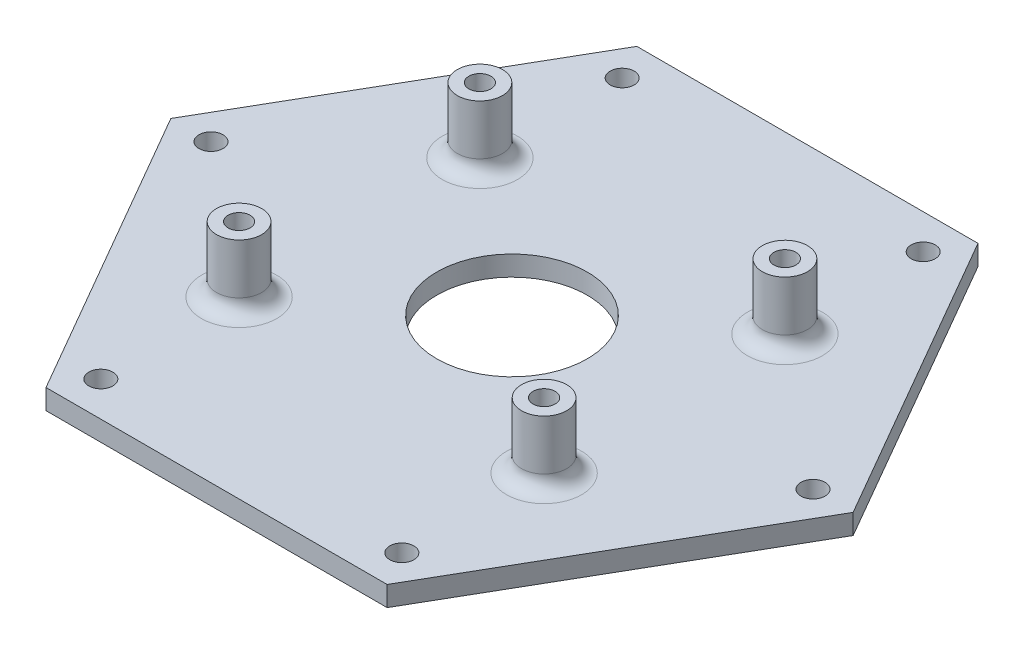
ISO-10303-21;
HEADER;
FILE_DESCRIPTION(('STEP AP214'),'2;1');
FILE_NAME('part.step','',(''),(''),'','','');
FILE_SCHEMA(('AUTOMOTIVE_DESIGN { 1 0 10303 214 1 1 1 1 }'));
ENDSEC;
DATA;
#1=APPLICATION_CONTEXT('core data for automotive mechanical design processes');
#2=APPLICATION_PROTOCOL_DEFINITION('international standard','automotive_design',2000,#1);
#3=PRODUCT_CONTEXT('',#1,'mechanical');
#4=PRODUCT('Part','Part','',(#3));
#5=PRODUCT_RELATED_PRODUCT_CATEGORY('part','',(#4));
#6=PRODUCT_DEFINITION_FORMATION('','',#4);
#7=PRODUCT_DEFINITION_CONTEXT('part definition',#1,'design');
#8=PRODUCT_DEFINITION('design','',#6,#7);
#9=PRODUCT_DEFINITION_SHAPE('','',#8);
#10=(LENGTH_UNIT() NAMED_UNIT(*) SI_UNIT(.MILLI.,.METRE.));
#11=(NAMED_UNIT(*) PLANE_ANGLE_UNIT() SI_UNIT($,.RADIAN.));
#12=(NAMED_UNIT(*) SI_UNIT($,.STERADIAN.) SOLID_ANGLE_UNIT());
#13=UNCERTAINTY_MEASURE_WITH_UNIT(LENGTH_MEASURE(1.E-05),#10,'distance_accuracy_value','');
#14=(GEOMETRIC_REPRESENTATION_CONTEXT(3) GLOBAL_UNCERTAINTY_ASSIGNED_CONTEXT((#13)) GLOBAL_UNIT_ASSIGNED_CONTEXT((#10,
#11,#12)) REPRESENTATION_CONTEXT('',''));
#15=CARTESIAN_POINT('',(0.,0.,0.));
#16=DIRECTION('',(0.,0.,1.));
#17=DIRECTION('',(1.,0.,0.));
#18=AXIS2_PLACEMENT_3D('',#15,#16,#17);
#19=CARTESIAN_POINT('',(17.,2.,29.4448637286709));
#20=DIRECTION('',(-0.866025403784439,0.,-0.5));
#21=DIRECTION('',(-0.5,0.,0.866025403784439));
#22=AXIS2_PLACEMENT_3D('',#19,#20,#21);
#23=PLANE('',#22);
#24=DIRECTION('',(0.5,0.,-0.866025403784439));
#25=VECTOR('',#24,1.);
#26=CARTESIAN_POINT('',(17.,0.,29.4448637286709));
#27=LINE('',#26,#25);
#28=CARTESIAN_POINT('',(17.,0.,29.4448637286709));
#29=VERTEX_POINT('',#28);
#30=CARTESIAN_POINT('',(34.,0.,0.));
#31=VERTEX_POINT('',#30);
#32=EDGE_CURVE('E119',#29,#31,#27,.T.);
#33=ORIENTED_EDGE('',*,*,#32,.T.);
#34=DIRECTION('',(0.,-1.,0.));
#35=VECTOR('',#34,1.);
#36=CARTESIAN_POINT('',(34.,2.,0.));
#37=LINE('',#36,#35);
#38=CARTESIAN_POINT('',(34.,2.,0.));
#39=VERTEX_POINT('',#38);
#40=EDGE_CURVE('E137',#39,#31,#37,.T.);
#41=ORIENTED_EDGE('',*,*,#40,.F.);
#42=DIRECTION('',(0.5,0.,-0.866025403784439));
#43=VECTOR('',#42,1.);
#44=CARTESIAN_POINT('',(17.,2.,29.4448637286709));
#45=LINE('',#44,#43);
#46=CARTESIAN_POINT('',(17.,2.,29.4448637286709));
#47=VERTEX_POINT('',#46);
#48=EDGE_CURVE('E130',#47,#39,#45,.T.);
#49=ORIENTED_EDGE('',*,*,#48,.F.);
#50=DIRECTION('',(0.,-1.,0.));
#51=VECTOR('',#50,1.);
#52=CARTESIAN_POINT('',(17.,2.,29.4448637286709));
#53=LINE('',#52,#51);
#54=EDGE_CURVE('E115',#47,#29,#53,.T.);
#55=ORIENTED_EDGE('',*,*,#54,.T.);
#56=EDGE_LOOP('',(#33,#41,#49,#55));
#57=FACE_BOUND('',#56,.T.);
#58=ADVANCED_FACE('F33',(#57),#23,.F.);
#59=CARTESIAN_POINT('',(34.,2.,0.));
#60=DIRECTION('',(-0.866025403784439,0.,0.5));
#61=DIRECTION('',(0.5,0.,0.866025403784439));
#62=AXIS2_PLACEMENT_3D('',#59,#60,#61);
#63=PLANE('',#62);
#64=DIRECTION('',(-0.5,0.,-0.866025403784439));
#65=VECTOR('',#64,1.);
#66=CARTESIAN_POINT('',(34.,0.,0.));
#67=LINE('',#66,#65);
#68=CARTESIAN_POINT('',(17.,0.,-29.4448637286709));
#69=VERTEX_POINT('',#68);
#70=EDGE_CURVE('E122',#31,#69,#67,.T.);
#71=ORIENTED_EDGE('',*,*,#70,.T.);
#72=DIRECTION('',(0.,-1.,0.));
#73=VECTOR('',#72,1.);
#74=CARTESIAN_POINT('',(17.,2.,-29.4448637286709));
#75=LINE('',#74,#73);
#76=CARTESIAN_POINT('',(17.,2.,-29.4448637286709));
#77=VERTEX_POINT('',#76);
#78=EDGE_CURVE('E134',#77,#69,#75,.T.);
#79=ORIENTED_EDGE('',*,*,#78,.F.);
#80=DIRECTION('',(-0.5,0.,-0.866025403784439));
#81=VECTOR('',#80,1.);
#82=CARTESIAN_POINT('',(34.,2.,0.));
#83=LINE('',#82,#81);
#84=EDGE_CURVE('E88',#39,#77,#83,.T.);
#85=ORIENTED_EDGE('',*,*,#84,.F.);
#86=ORIENTED_EDGE('',*,*,#40,.T.);
#87=EDGE_LOOP('',(#71,#79,#85,#86));
#88=FACE_BOUND('',#87,.T.);
#89=ADVANCED_FACE('F176',(#88),#63,.F.);
#90=CARTESIAN_POINT('',(17.,2.,-29.4448637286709));
#91=DIRECTION('',(0.,0.,1.));
#92=DIRECTION('',(1.,0.,0.));
#93=AXIS2_PLACEMENT_3D('',#90,#91,#92);
#94=PLANE('',#93);
#95=DIRECTION('',(-1.,0.,0.));
#96=VECTOR('',#95,1.);
#97=CARTESIAN_POINT('',(17.,0.,-29.4448637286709));
#98=LINE('',#97,#96);
#99=CARTESIAN_POINT('',(-17.,0.,-29.4448637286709));
#100=VERTEX_POINT('',#99);
#101=EDGE_CURVE('E125',#69,#100,#98,.T.);
#102=ORIENTED_EDGE('',*,*,#101,.T.);
#103=DIRECTION('',(0.,-1.,0.));
#104=VECTOR('',#103,1.);
#105=CARTESIAN_POINT('',(-17.,2.,-29.4448637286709));
#106=LINE('',#105,#104);
#107=CARTESIAN_POINT('',(-17.,2.,-29.4448637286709));
#108=VERTEX_POINT('',#107);
#109=EDGE_CURVE('E110',#108,#100,#106,.T.);
#110=ORIENTED_EDGE('',*,*,#109,.F.);
#111=DIRECTION('',(-1.,0.,0.));
#112=VECTOR('',#111,1.);
#113=CARTESIAN_POINT('',(17.,2.,-29.4448637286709));
#114=LINE('',#113,#112);
#115=EDGE_CURVE('E101',#77,#108,#114,.T.);
#116=ORIENTED_EDGE('',*,*,#115,.F.);
#117=ORIENTED_EDGE('',*,*,#78,.T.);
#118=EDGE_LOOP('',(#102,#110,#116,#117));
#119=FACE_BOUND('',#118,.T.);
#120=ADVANCED_FACE('F182',(#119),#94,.F.);
#121=CARTESIAN_POINT('',(-17.,2.,-29.4448637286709));
#122=DIRECTION('',(0.866025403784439,0.,0.5));
#123=DIRECTION('',(0.5,0.,-0.866025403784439));
#124=AXIS2_PLACEMENT_3D('',#121,#122,#123);
#125=PLANE('',#124);
#126=DIRECTION('',(-0.5,0.,0.866025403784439));
#127=VECTOR('',#126,1.);
#128=CARTESIAN_POINT('',(-17.,0.,-29.4448637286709));
#129=LINE('',#128,#127);
#130=CARTESIAN_POINT('',(-34.,0.,0.));
#131=VERTEX_POINT('',#130);
#132=EDGE_CURVE('E109',#100,#131,#129,.T.);
#133=ORIENTED_EDGE('',*,*,#132,.T.);
#134=DIRECTION('',(0.,-1.,0.));
#135=VECTOR('',#134,1.);
#136=CARTESIAN_POINT('',(-34.,2.,0.));
#137=LINE('',#136,#135);
#138=CARTESIAN_POINT('',(-34.,2.,0.));
#139=VERTEX_POINT('',#138);
#140=EDGE_CURVE('E106',#139,#131,#137,.T.);
#141=ORIENTED_EDGE('',*,*,#140,.F.);
#142=DIRECTION('',(-0.5,0.,0.866025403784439));
#143=VECTOR('',#142,1.);
#144=CARTESIAN_POINT('',(-17.,2.,-29.4448637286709));
#145=LINE('',#144,#143);
#146=EDGE_CURVE('E95',#108,#139,#145,.T.);
#147=ORIENTED_EDGE('',*,*,#146,.F.);
#148=ORIENTED_EDGE('',*,*,#109,.T.);
#149=EDGE_LOOP('',(#133,#141,#147,#148));
#150=FACE_BOUND('',#149,.T.);
#151=ADVANCED_FACE('F107',(#150),#125,.F.);
#152=CARTESIAN_POINT('',(-34.,2.,0.));
#153=DIRECTION('',(0.866025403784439,0.,-0.5));
#154=DIRECTION('',(-0.5,0.,-0.866025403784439));
#155=AXIS2_PLACEMENT_3D('',#152,#153,#154);
#156=PLANE('',#155);
#157=DIRECTION('',(0.5,0.,0.866025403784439));
#158=VECTOR('',#157,1.);
#159=CARTESIAN_POINT('',(-34.,0.,0.));
#160=LINE('',#159,#158);
#161=CARTESIAN_POINT('',(-17.,0.,29.4448637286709));
#162=VERTEX_POINT('',#161);
#163=EDGE_CURVE('E73',#131,#162,#160,.T.);
#164=ORIENTED_EDGE('',*,*,#163,.T.);
#165=DIRECTION('',(0.,-1.,0.));
#166=VECTOR('',#165,1.);
#167=CARTESIAN_POINT('',(-17.,2.,29.4448637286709));
#168=LINE('',#167,#166);
#169=CARTESIAN_POINT('',(-17.,2.,29.4448637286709));
#170=VERTEX_POINT('',#169);
#171=EDGE_CURVE('E111',#170,#162,#168,.T.);
#172=ORIENTED_EDGE('',*,*,#171,.F.);
#173=DIRECTION('',(0.5,0.,0.866025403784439));
#174=VECTOR('',#173,1.);
#175=CARTESIAN_POINT('',(-34.,2.,0.));
#176=LINE('',#175,#174);
#177=EDGE_CURVE('E99',#139,#170,#176,.T.);
#178=ORIENTED_EDGE('',*,*,#177,.F.);
#179=ORIENTED_EDGE('',*,*,#140,.T.);
#180=EDGE_LOOP('',(#164,#172,#178,#179));
#181=FACE_BOUND('',#180,.T.);
#182=ADVANCED_FACE('F113',(#181),#156,.F.);
#183=CARTESIAN_POINT('',(-17.,2.,29.4448637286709));
#184=DIRECTION('',(0.,0.,-1.));
#185=DIRECTION('',(-1.,0.,0.));
#186=AXIS2_PLACEMENT_3D('',#183,#184,#185);
#187=PLANE('',#186);
#188=DIRECTION('',(1.,0.,0.));
#189=VECTOR('',#188,1.);
#190=CARTESIAN_POINT('',(-17.,0.,29.4448637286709));
#191=LINE('',#190,#189);
#192=EDGE_CURVE('E79',#162,#29,#191,.T.);
#193=ORIENTED_EDGE('',*,*,#192,.T.);
#194=ORIENTED_EDGE('',*,*,#54,.F.);
#195=DIRECTION('',(1.,0.,0.));
#196=VECTOR('',#195,1.);
#197=CARTESIAN_POINT('',(-17.,2.,29.4448637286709));
#198=LINE('',#197,#196);
#199=EDGE_CURVE('E50',#170,#47,#198,.T.);
#200=ORIENTED_EDGE('',*,*,#199,.F.);
#201=ORIENTED_EDGE('',*,*,#171,.T.);
#202=EDGE_LOOP('',(#193,#194,#200,#201));
#203=FACE_BOUND('',#202,.T.);
#204=ADVANCED_FACE('F226',(#203),#187,.F.);
#205=CARTESIAN_POINT('',(0.,2.,0.));
#206=DIRECTION('',(0.,1.,0.));
#207=DIRECTION('',(0.,0.,1.));
#208=AXIS2_PLACEMENT_3D('',#205,#206,#207);
#209=PLANE('',#208);
#210=CARTESIAN_POINT('',(15.2000000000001,2.,-12.0000000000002));
#211=DIRECTION('',(0.,1.,0.));
#212=DIRECTION('',(0.,0.,1.));
#213=AXIS2_PLACEMENT_3D('',#210,#211,#212);
#214=CIRCLE('',#213,3.75);
#215=CARTESIAN_POINT('',(15.2000000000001,2.,-8.2500000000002));
#216=VERTEX_POINT('',#215);
#217=EDGE_CURVE('E151',#216,#216,#214,.F.);
#218=ORIENTED_EDGE('',*,*,#217,.T.);
#219=EDGE_LOOP('',(#218));
#220=FACE_BOUND('',#219,.T.);
#221=CARTESIAN_POINT('',(-15.2,2.,-12.));
#222=DIRECTION('',(0.,1.,0.));
#223=DIRECTION('',(0.,0.,1.));
#224=AXIS2_PLACEMENT_3D('',#221,#222,#223);
#225=CIRCLE('',#224,3.75);
#226=CARTESIAN_POINT('',(-15.2,2.,-8.25));
#227=VERTEX_POINT('',#226);
#228=EDGE_CURVE('E148',#227,#227,#225,.F.);
#229=ORIENTED_EDGE('',*,*,#228,.T.);
#230=EDGE_LOOP('',(#229));
#231=FACE_BOUND('',#230,.T.);
#232=CARTESIAN_POINT('',(15.2000000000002,2.,12.0000000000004));
#233=DIRECTION('',(0.,1.,0.));
#234=DIRECTION('',(0.,0.,1.));
#235=AXIS2_PLACEMENT_3D('',#232,#233,#234);
#236=CIRCLE('',#235,3.75);
#237=CARTESIAN_POINT('',(15.2000000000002,2.,15.7500000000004));
#238=VERTEX_POINT('',#237);
#239=EDGE_CURVE('E145',#238,#238,#236,.F.);
#240=ORIENTED_EDGE('',*,*,#239,.T.);
#241=EDGE_LOOP('',(#240));
#242=FACE_BOUND('',#241,.T.);
#243=CARTESIAN_POINT('',(-15.1999999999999,2.,12.0000000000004));
#244=DIRECTION('',(0.,1.,0.));
#245=DIRECTION('',(0.,0.,1.));
#246=AXIS2_PLACEMENT_3D('',#243,#244,#245);
#247=CIRCLE('',#246,3.75);
#248=CARTESIAN_POINT('',(-15.1999999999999,2.,15.7500000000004));
#249=VERTEX_POINT('',#248);
#250=EDGE_CURVE('E142',#249,#249,#247,.F.);
#251=ORIENTED_EDGE('',*,*,#250,.T.);
#252=EDGE_LOOP('',(#251));
#253=FACE_BOUND('',#252,.T.);
#254=CARTESIAN_POINT('',(-15.0000000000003,2.,-25.980762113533));
#255=DIRECTION('',(0.,1.,0.));
#256=DIRECTION('',(-0.866025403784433,0.,0.50000000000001));
#257=AXIS2_PLACEMENT_3D('',#254,#255,#256);
#258=CIRCLE('',#257,1.2);
#259=CARTESIAN_POINT('',(-16.0392304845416,2.,-25.380762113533));
#260=VERTEX_POINT('',#259);
#261=EDGE_CURVE('E494',#260,#260,#258,.T.);
#262=ORIENTED_EDGE('',*,*,#261,.F.);
#263=EDGE_LOOP('',(#262));
#264=FACE_BOUND('',#263,.T.);
#265=CARTESIAN_POINT('',(14.9999999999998,2.,-25.9807621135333));
#266=DIRECTION('',(0.,1.,0.));
#267=DIRECTION('',(-0.866025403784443,0.,-0.499999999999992));
#268=AXIS2_PLACEMENT_3D('',#265,#266,#267);
#269=CIRCLE('',#268,1.2);
#270=CARTESIAN_POINT('',(13.9607695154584,2.,-26.5807621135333));
#271=VERTEX_POINT('',#270);
#272=EDGE_CURVE('E487',#271,#271,#269,.T.);
#273=ORIENTED_EDGE('',*,*,#272,.F.);
#274=EDGE_LOOP('',(#273));
#275=FACE_BOUND('',#274,.T.);
#276=CARTESIAN_POINT('',(30.,2.,0.));
#277=DIRECTION('',(0.,1.,0.));
#278=DIRECTION('',(0.,0.,-1.));
#279=AXIS2_PLACEMENT_3D('',#276,#277,#278);
#280=CIRCLE('',#279,1.2);
#281=CARTESIAN_POINT('',(30.,2.,-1.2));
#282=VERTEX_POINT('',#281);
#283=EDGE_CURVE('E491',#282,#282,#280,.T.);
#284=ORIENTED_EDGE('',*,*,#283,.F.);
#285=EDGE_LOOP('',(#284));
#286=FACE_BOUND('',#285,.T.);
#287=CARTESIAN_POINT('',(15.0000000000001,2.,25.9807621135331));
#288=DIRECTION('',(0.,1.,0.));
#289=DIRECTION('',(0.866025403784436,0.,-0.500000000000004));
#290=AXIS2_PLACEMENT_3D('',#287,#288,#289);
#291=CIRCLE('',#290,1.2);
#292=CARTESIAN_POINT('',(16.0392304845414,2.,25.3807621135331));
#293=VERTEX_POINT('',#292);
#294=EDGE_CURVE('E574',#293,#293,#291,.T.);
#295=ORIENTED_EDGE('',*,*,#294,.F.);
#296=EDGE_LOOP('',(#295));
#297=FACE_BOUND('',#296,.T.);
#298=CARTESIAN_POINT('',(-14.9999999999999,2.,25.9807621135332));
#299=DIRECTION('',(0.,1.,0.));
#300=DIRECTION('',(0.86602540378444,0.,0.499999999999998));
#301=AXIS2_PLACEMENT_3D('',#298,#299,#300);
#302=CIRCLE('',#301,1.2);
#303=CARTESIAN_POINT('',(-13.9607695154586,2.,26.5807621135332));
#304=VERTEX_POINT('',#303);
#305=EDGE_CURVE('E504',#304,#304,#302,.T.);
#306=ORIENTED_EDGE('',*,*,#305,.F.);
#307=EDGE_LOOP('',(#306));
#308=FACE_BOUND('',#307,.T.);
#309=CARTESIAN_POINT('',(-30.,2.,0.));
#310=DIRECTION('',(0.,1.,0.));
#311=DIRECTION('',(0.,0.,1.));
#312=AXIS2_PLACEMENT_3D('',#309,#310,#311);
#313=CIRCLE('',#312,1.2);
#314=CARTESIAN_POINT('',(-30.,2.,1.2));
#315=VERTEX_POINT('',#314);
#316=EDGE_CURVE('E503',#315,#315,#313,.T.);
#317=ORIENTED_EDGE('',*,*,#316,.F.);
#318=EDGE_LOOP('',(#317));
#319=FACE_BOUND('',#318,.T.);
#320=CARTESIAN_POINT('',(0.,2.,0.));
#321=DIRECTION('',(0.,1.,0.));
#322=DIRECTION('',(0.,0.,1.));
#323=AXIS2_PLACEMENT_3D('',#320,#321,#322);
#324=CIRCLE('',#323,7.5);
#325=CARTESIAN_POINT('',(0.,2.,7.5));
#326=VERTEX_POINT('',#325);
#327=EDGE_CURVE('E511',#326,#326,#324,.T.);
#328=ORIENTED_EDGE('',*,*,#327,.F.);
#329=EDGE_LOOP('',(#328));
#330=FACE_BOUND('',#329,.T.);
#331=ORIENTED_EDGE('',*,*,#48,.T.);
#332=ORIENTED_EDGE('',*,*,#84,.T.);
#333=ORIENTED_EDGE('',*,*,#115,.T.);
#334=ORIENTED_EDGE('',*,*,#146,.T.);
#335=ORIENTED_EDGE('',*,*,#177,.T.);
#336=ORIENTED_EDGE('',*,*,#199,.T.);
#337=EDGE_LOOP('',(#331,#332,#333,#334,#335,#336));
#338=FACE_BOUND('',#337,.T.);
#339=ADVANCED_FACE('F97',(#220,#231,#242,#253,#264,#275,#286,#297,#308,#319,#330,#338),#209,.T.);
#340=CARTESIAN_POINT('',(0.,0.,0.));
#341=DIRECTION('',(0.,1.,0.));
#342=DIRECTION('',(0.,0.,1.));
#343=AXIS2_PLACEMENT_3D('',#340,#341,#342);
#344=PLANE('',#343);
#345=CARTESIAN_POINT('',(-15.0000000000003,0.,-25.980762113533));
#346=DIRECTION('',(0.,1.,0.));
#347=DIRECTION('',(-0.866025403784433,0.,0.50000000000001));
#348=AXIS2_PLACEMENT_3D('',#345,#346,#347);
#349=CIRCLE('',#348,1.2);
#350=CARTESIAN_POINT('',(-16.0392304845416,0.,-25.380762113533));
#351=VERTEX_POINT('',#350);
#352=EDGE_CURVE('E489',#351,#351,#349,.T.);
#353=ORIENTED_EDGE('',*,*,#352,.T.);
#354=EDGE_LOOP('',(#353));
#355=FACE_BOUND('',#354,.T.);
#356=CARTESIAN_POINT('',(14.9999999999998,0.,-25.9807621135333));
#357=DIRECTION('',(0.,1.,0.));
#358=DIRECTION('',(-0.866025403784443,0.,-0.499999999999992));
#359=AXIS2_PLACEMENT_3D('',#356,#357,#358);
#360=CIRCLE('',#359,1.2);
#361=CARTESIAN_POINT('',(13.9607695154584,0.,-26.5807621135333));
#362=VERTEX_POINT('',#361);
#363=EDGE_CURVE('E484',#362,#362,#360,.T.);
#364=ORIENTED_EDGE('',*,*,#363,.T.);
#365=EDGE_LOOP('',(#364));
#366=FACE_BOUND('',#365,.T.);
#367=CARTESIAN_POINT('',(30.,0.,0.));
#368=DIRECTION('',(0.,1.,0.));
#369=DIRECTION('',(0.,0.,-1.));
#370=AXIS2_PLACEMENT_3D('',#367,#368,#369);
#371=CIRCLE('',#370,1.2);
#372=CARTESIAN_POINT('',(30.,0.,-1.2));
#373=VERTEX_POINT('',#372);
#374=EDGE_CURVE('E579',#373,#373,#371,.T.);
#375=ORIENTED_EDGE('',*,*,#374,.T.);
#376=EDGE_LOOP('',(#375));
#377=FACE_BOUND('',#376,.T.);
#378=CARTESIAN_POINT('',(15.0000000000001,0.,25.9807621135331));
#379=DIRECTION('',(0.,1.,0.));
#380=DIRECTION('',(0.866025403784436,0.,-0.500000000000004));
#381=AXIS2_PLACEMENT_3D('',#378,#379,#380);
#382=CIRCLE('',#381,1.2);
#383=CARTESIAN_POINT('',(16.0392304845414,0.,25.3807621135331));
#384=VERTEX_POINT('',#383);
#385=EDGE_CURVE('E507',#384,#384,#382,.T.);
#386=ORIENTED_EDGE('',*,*,#385,.T.);
#387=EDGE_LOOP('',(#386));
#388=FACE_BOUND('',#387,.T.);
#389=CARTESIAN_POINT('',(-14.9999999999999,0.,25.9807621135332));
#390=DIRECTION('',(0.,1.,0.));
#391=DIRECTION('',(0.86602540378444,0.,0.499999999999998));
#392=AXIS2_PLACEMENT_3D('',#389,#390,#391);
#393=CIRCLE('',#392,1.2);
#394=CARTESIAN_POINT('',(-13.9607695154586,0.,26.5807621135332));
#395=VERTEX_POINT('',#394);
#396=EDGE_CURVE('E500',#395,#395,#393,.T.);
#397=ORIENTED_EDGE('',*,*,#396,.T.);
#398=EDGE_LOOP('',(#397));
#399=FACE_BOUND('',#398,.T.);
#400=CARTESIAN_POINT('',(-30.,0.,0.));
#401=DIRECTION('',(0.,1.,0.));
#402=DIRECTION('',(0.,0.,1.));
#403=AXIS2_PLACEMENT_3D('',#400,#401,#402);
#404=CIRCLE('',#403,1.2);
#405=CARTESIAN_POINT('',(-30.,0.,1.2));
#406=VERTEX_POINT('',#405);
#407=EDGE_CURVE('E508',#406,#406,#404,.T.);
#408=ORIENTED_EDGE('',*,*,#407,.T.);
#409=EDGE_LOOP('',(#408));
#410=FACE_BOUND('',#409,.T.);
#411=CARTESIAN_POINT('',(0.,0.,0.));
#412=DIRECTION('',(0.,1.,0.));
#413=DIRECTION('',(0.,0.,1.));
#414=AXIS2_PLACEMENT_3D('',#411,#412,#413);
#415=CIRCLE('',#414,7.5);
#416=CARTESIAN_POINT('',(0.,0.,7.5));
#417=VERTEX_POINT('',#416);
#418=EDGE_CURVE('E514',#417,#417,#415,.T.);
#419=ORIENTED_EDGE('',*,*,#418,.T.);
#420=EDGE_LOOP('',(#419));
#421=FACE_BOUND('',#420,.T.);
#422=CARTESIAN_POINT('',(-15.1999999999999,0.,12.0000000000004));
#423=DIRECTION('',(0.,1.,0.));
#424=DIRECTION('',(0.,0.,1.));
#425=AXIS2_PLACEMENT_3D('',#422,#423,#424);
#426=CIRCLE('',#425,1.1);
#427=CARTESIAN_POINT('',(-15.1999999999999,0.,13.1000000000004));
#428=VERTEX_POINT('',#427);
#429=EDGE_CURVE('E533',#428,#428,#426,.T.);
#430=ORIENTED_EDGE('',*,*,#429,.T.);
#431=EDGE_LOOP('',(#430));
#432=FACE_BOUND('',#431,.T.);
#433=CARTESIAN_POINT('',(15.2000000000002,0.,12.0000000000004));
#434=DIRECTION('',(0.,1.,0.));
#435=DIRECTION('',(0.,0.,1.));
#436=AXIS2_PLACEMENT_3D('',#433,#434,#435);
#437=CIRCLE('',#436,1.1);
#438=CARTESIAN_POINT('',(15.2000000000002,0.,13.1000000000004));
#439=VERTEX_POINT('',#438);
#440=EDGE_CURVE('E527',#439,#439,#437,.T.);
#441=ORIENTED_EDGE('',*,*,#440,.T.);
#442=EDGE_LOOP('',(#441));
#443=FACE_BOUND('',#442,.T.);
#444=CARTESIAN_POINT('',(15.2000000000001,0.,-12.0000000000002));
#445=DIRECTION('',(0.,1.,0.));
#446=DIRECTION('',(0.,0.,1.));
#447=AXIS2_PLACEMENT_3D('',#444,#445,#446);
#448=CIRCLE('',#447,1.1);
#449=CARTESIAN_POINT('',(15.2000000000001,0.,-10.9000000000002));
#450=VERTEX_POINT('',#449);
#451=EDGE_CURVE('E520',#450,#450,#448,.T.);
#452=ORIENTED_EDGE('',*,*,#451,.T.);
#453=EDGE_LOOP('',(#452));
#454=FACE_BOUND('',#453,.T.);
#455=CARTESIAN_POINT('',(-15.2,0.,-12.));
#456=DIRECTION('',(0.,1.,0.));
#457=DIRECTION('',(0.,0.,1.));
#458=AXIS2_PLACEMENT_3D('',#455,#456,#457);
#459=CIRCLE('',#458,1.1);
#460=CARTESIAN_POINT('',(-15.2,0.,-10.9));
#461=VERTEX_POINT('',#460);
#462=EDGE_CURVE('E538',#461,#461,#459,.T.);
#463=ORIENTED_EDGE('',*,*,#462,.T.);
#464=EDGE_LOOP('',(#463));
#465=FACE_BOUND('',#464,.T.);
#466=ORIENTED_EDGE('',*,*,#32,.F.);
#467=ORIENTED_EDGE('',*,*,#192,.F.);
#468=ORIENTED_EDGE('',*,*,#163,.F.);
#469=ORIENTED_EDGE('',*,*,#132,.F.);
#470=ORIENTED_EDGE('',*,*,#101,.F.);
#471=ORIENTED_EDGE('',*,*,#70,.F.);
#472=EDGE_LOOP('',(#466,#467,#468,#469,#470,#471));
#473=FACE_BOUND('',#472,.T.);
#474=ADVANCED_FACE('F225',(#355,#366,#377,#388,#399,#410,#421,#432,#443,#454,#465,#473),#344,.F.);
#475=CARTESIAN_POINT('',(-15.2,8.5,-12.));
#476=DIRECTION('',(0.,-1.,0.));
#477=DIRECTION('',(0.,0.,-1.));
#478=AXIS2_PLACEMENT_3D('',#475,#476,#477);
#479=CYLINDRICAL_SURFACE('',#478,2.25);
#480=CARTESIAN_POINT('',(-15.2,3.5,-12.));
#481=DIRECTION('',(0.,1.,0.));
#482=DIRECTION('',(0.,0.,1.));
#483=AXIS2_PLACEMENT_3D('',#480,#481,#482);
#484=CIRCLE('',#483,2.25);
#485=CARTESIAN_POINT('',(-15.2,3.5,-14.25));
#486=VERTEX_POINT('',#485);
#487=EDGE_CURVE('E154',#486,#486,#484,.T.);
#488=CARTESIAN_POINT('',(-15.2,8.5,-12.));
#489=DIRECTION('',(0.,1.,0.));
#490=DIRECTION('',(0.,0.,1.));
#491=AXIS2_PLACEMENT_3D('',#488,#489,#490);
#492=CIRCLE('',#491,2.25);
#493=CARTESIAN_POINT('',(-15.2,8.5,-14.25));
#494=VERTEX_POINT('',#493);
#495=EDGE_CURVE('E123',#494,#494,#492,.T.);
#496=CARTESIAN_POINT('',(-15.2,3.5,-14.25));
#497=CARTESIAN_POINT('',(-15.2,3.55208333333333,-14.25));
#498=CARTESIAN_POINT('',(-15.2,3.60416666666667,-14.25));
#499=CARTESIAN_POINT('',(-15.2,3.70833333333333,-14.25));
#500=CARTESIAN_POINT('',(-15.2,3.76041666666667,-14.25));
#501=CARTESIAN_POINT('',(-15.2,3.86458333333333,-14.25));
#502=CARTESIAN_POINT('',(-15.2,3.91666666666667,-14.25));
#503=CARTESIAN_POINT('',(-15.2,4.02083333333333,-14.25));
#504=CARTESIAN_POINT('',(-15.2,4.07291666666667,-14.25));
#505=CARTESIAN_POINT('',(-15.2,4.17708333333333,-14.25));
#506=CARTESIAN_POINT('',(-15.2,4.22916666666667,-14.25));
#507=CARTESIAN_POINT('',(-15.2,4.33333333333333,-14.25));
#508=CARTESIAN_POINT('',(-15.2,4.38541666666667,-14.25));
#509=CARTESIAN_POINT('',(-15.2,4.48958333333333,-14.25));
#510=CARTESIAN_POINT('',(-15.2,4.54166666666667,-14.25));
#511=CARTESIAN_POINT('',(-15.2,4.64583333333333,-14.25));
#512=CARTESIAN_POINT('',(-15.2,4.69791666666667,-14.25));
#513=CARTESIAN_POINT('',(-15.2,4.80208333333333,-14.25));
#514=CARTESIAN_POINT('',(-15.2,4.85416666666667,-14.25));
#515=CARTESIAN_POINT('',(-15.2,4.95833333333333,-14.25));
#516=CARTESIAN_POINT('',(-15.2,5.01041666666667,-14.25));
#517=CARTESIAN_POINT('',(-15.2,5.11458333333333,-14.25));
#518=CARTESIAN_POINT('',(-15.2,5.16666666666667,-14.25));
#519=CARTESIAN_POINT('',(-15.2,5.27083333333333,-14.25));
#520=CARTESIAN_POINT('',(-15.2,5.32291666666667,-14.25));
#521=CARTESIAN_POINT('',(-15.2,5.42708333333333,-14.25));
#522=CARTESIAN_POINT('',(-15.2,5.47916666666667,-14.25));
#523=CARTESIAN_POINT('',(-15.2,5.58333333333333,-14.25));
#524=CARTESIAN_POINT('',(-15.2,5.63541666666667,-14.25));
#525=CARTESIAN_POINT('',(-15.2,5.73958333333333,-14.25));
#526=CARTESIAN_POINT('',(-15.2,5.79166666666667,-14.25));
#527=CARTESIAN_POINT('',(-15.2,5.89583333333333,-14.25));
#528=CARTESIAN_POINT('',(-15.2,5.94791666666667,-14.25));
#529=CARTESIAN_POINT('',(-15.2,6.05208333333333,-14.25));
#530=CARTESIAN_POINT('',(-15.2,6.10416666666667,-14.25));
#531=CARTESIAN_POINT('',(-15.2,6.20833333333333,-14.25));
#532=CARTESIAN_POINT('',(-15.2,6.26041666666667,-14.25));
#533=CARTESIAN_POINT('',(-15.2,6.36458333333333,-14.25));
#534=CARTESIAN_POINT('',(-15.2,6.41666666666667,-14.25));
#535=CARTESIAN_POINT('',(-15.2,6.52083333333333,-14.25));
#536=CARTESIAN_POINT('',(-15.2,6.57291666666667,-14.25));
#537=CARTESIAN_POINT('',(-15.2,6.67708333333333,-14.25));
#538=CARTESIAN_POINT('',(-15.2,6.72916666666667,-14.25));
#539=CARTESIAN_POINT('',(-15.2,6.83333333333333,-14.25));
#540=CARTESIAN_POINT('',(-15.2,6.88541666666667,-14.25));
#541=CARTESIAN_POINT('',(-15.2,6.98958333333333,-14.25));
#542=CARTESIAN_POINT('',(-15.2,7.04166666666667,-14.25));
#543=CARTESIAN_POINT('',(-15.2,7.14583333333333,-14.25));
#544=CARTESIAN_POINT('',(-15.2,7.19791666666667,-14.25));
#545=CARTESIAN_POINT('',(-15.2,7.30208333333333,-14.25));
#546=CARTESIAN_POINT('',(-15.2,7.35416666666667,-14.25));
#547=CARTESIAN_POINT('',(-15.2,7.45833333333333,-14.25));
#548=CARTESIAN_POINT('',(-15.2,7.51041666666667,-14.25));
#549=CARTESIAN_POINT('',(-15.2,7.61458333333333,-14.25));
#550=CARTESIAN_POINT('',(-15.2,7.66666666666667,-14.25));
#551=CARTESIAN_POINT('',(-15.2,7.77083333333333,-14.25));
#552=CARTESIAN_POINT('',(-15.2,7.82291666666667,-14.25));
#553=CARTESIAN_POINT('',(-15.2,7.92708333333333,-14.25));
#554=CARTESIAN_POINT('',(-15.2,7.97916666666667,-14.25));
#555=CARTESIAN_POINT('',(-15.2,8.08333333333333,-14.25));
#556=CARTESIAN_POINT('',(-15.2,8.13541666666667,-14.25));
#557=CARTESIAN_POINT('',(-15.2,8.23958333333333,-14.25));
#558=CARTESIAN_POINT('',(-15.2,8.29166666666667,-14.25));
#559=CARTESIAN_POINT('',(-15.2,8.39583333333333,-14.25));
#560=CARTESIAN_POINT('',(-15.2,8.44791666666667,-14.25));
#561=CARTESIAN_POINT('',(-15.2,8.5,-14.25));
#562=B_SPLINE_CURVE_WITH_KNOTS('',3,(#496,#497,#498,#499,#500,#501,#502,#503,#504,#505,#506,
#507,#508,#509,#510,#511,#512,#513,#514,#515,#516,#517,#518,#519,#520,#521,#522,#523,#524,#525,
#526,#527,#528,#529,#530,#531,#532,#533,#534,#535,#536,#537,#538,#539,#540,#541,#542,#543,#544,
#545,#546,#547,#548,#549,#550,#551,#552,#553,#554,#555,#556,#557,#558,#559,#560,#561),
.UNSPECIFIED.,.F.,.F.,(4,2,2,2,2,2,2,2,2,2,2,2,2,2,2,2,2,2,2,2,2,2,2,2,2,2,2,2,2,2,2,2,4),(0.,
0.15625,0.3125,0.46875,0.625,0.78125,0.9375,1.09375,1.25,1.40625,1.5625,1.71875,1.875,2.03125,
2.1875,2.34375,2.5,2.65625,2.8125,2.96875,3.125,3.28125,3.4375,3.59375,3.75,3.90625,4.0625,
4.21875,4.375,4.53125,4.6875,4.84375,5.),.UNSPECIFIED.);
#563=EDGE_CURVE('BSEAM266',#486,#494,#562,.T.);
#564=ORIENTED_EDGE('',*,*,#487,.T.);
#565=ORIENTED_EDGE('',*,*,#495,.F.);
#566=ORIENTED_EDGE('',*,*,#563,.T.);
#567=ORIENTED_EDGE('',*,*,#563,.F.);
#568=EDGE_LOOP('',(#564,#566,#565,#567));
#569=FACE_BOUND('',#568,.T.);
#570=ADVANCED_FACE('F266',(#569),#479,.T.);
#571=CARTESIAN_POINT('',(-15.2,8.5,-12.));
#572=DIRECTION('',(0.,1.,0.));
#573=DIRECTION('',(0.,0.,1.));
#574=AXIS2_PLACEMENT_3D('',#571,#572,#573);
#575=PLANE('',#574);
#576=CARTESIAN_POINT('',(-15.2,8.5,-12.));
#577=DIRECTION('',(0.,1.,0.));
#578=DIRECTION('',(0.,0.,1.));
#579=AXIS2_PLACEMENT_3D('',#576,#577,#578);
#580=CIRCLE('',#579,1.1);
#581=CARTESIAN_POINT('',(-15.2,8.5,-10.9));
#582=VERTEX_POINT('',#581);
#583=EDGE_CURVE('E523',#582,#582,#580,.T.);
#584=ORIENTED_EDGE('',*,*,#583,.F.);
#585=EDGE_LOOP('',(#584));
#586=FACE_BOUND('',#585,.T.);
#587=ORIENTED_EDGE('',*,*,#495,.T.);
#588=EDGE_LOOP('',(#587));
#589=FACE_BOUND('',#588,.T.);
#590=ADVANCED_FACE('F203',(#586,#589),#575,.T.);
#591=CARTESIAN_POINT('',(15.2000000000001,8.5,-12.0000000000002));
#592=DIRECTION('',(0.,-1.,0.));
#593=DIRECTION('',(0.,0.,-1.));
#594=AXIS2_PLACEMENT_3D('',#591,#592,#593);
#595=CYLINDRICAL_SURFACE('',#594,2.25);
#596=CARTESIAN_POINT('',(15.2000000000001,3.5,-12.0000000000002));
#597=DIRECTION('',(0.,1.,0.));
#598=DIRECTION('',(0.,0.,1.));
#599=AXIS2_PLACEMENT_3D('',#596,#597,#598);
#600=CIRCLE('',#599,2.25);
#601=CARTESIAN_POINT('',(15.2000000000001,3.5,-14.2500000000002));
#602=VERTEX_POINT('',#601);
#603=EDGE_CURVE('E139',#602,#602,#600,.T.);
#604=CARTESIAN_POINT('',(15.2000000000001,8.5,-12.0000000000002));
#605=DIRECTION('',(0.,1.,0.));
#606=DIRECTION('',(0.,0.,-1.));
#607=AXIS2_PLACEMENT_3D('',#604,#605,#606);
#608=CIRCLE('',#607,2.25);
#609=CARTESIAN_POINT('',(15.2000000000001,8.5,-14.2500000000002));
#610=VERTEX_POINT('',#609);
#611=EDGE_CURVE('E207',#610,#610,#608,.T.);
#612=CARTESIAN_POINT('',(15.2000000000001,3.5,-14.2500000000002));
#613=CARTESIAN_POINT('',(15.2000000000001,3.55208333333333,-14.2500000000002));
#614=CARTESIAN_POINT('',(15.2000000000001,3.60416666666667,-14.2500000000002));
#615=CARTESIAN_POINT('',(15.2000000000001,3.70833333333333,-14.2500000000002));
#616=CARTESIAN_POINT('',(15.2000000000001,3.76041666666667,-14.2500000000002));
#617=CARTESIAN_POINT('',(15.2000000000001,3.86458333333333,-14.2500000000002));
#618=CARTESIAN_POINT('',(15.2000000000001,3.91666666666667,-14.2500000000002));
#619=CARTESIAN_POINT('',(15.2000000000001,4.02083333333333,-14.2500000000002));
#620=CARTESIAN_POINT('',(15.2000000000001,4.07291666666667,-14.2500000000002));
#621=CARTESIAN_POINT('',(15.2000000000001,4.17708333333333,-14.2500000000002));
#622=CARTESIAN_POINT('',(15.2000000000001,4.22916666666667,-14.2500000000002));
#623=CARTESIAN_POINT('',(15.2000000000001,4.33333333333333,-14.2500000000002));
#624=CARTESIAN_POINT('',(15.2000000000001,4.38541666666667,-14.2500000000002));
#625=CARTESIAN_POINT('',(15.2000000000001,4.48958333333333,-14.2500000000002));
#626=CARTESIAN_POINT('',(15.2000000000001,4.54166666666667,-14.2500000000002));
#627=CARTESIAN_POINT('',(15.2000000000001,4.64583333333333,-14.2500000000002));
#628=CARTESIAN_POINT('',(15.2000000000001,4.69791666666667,-14.2500000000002));
#629=CARTESIAN_POINT('',(15.2000000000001,4.80208333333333,-14.2500000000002));
#630=CARTESIAN_POINT('',(15.2000000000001,4.85416666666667,-14.2500000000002));
#631=CARTESIAN_POINT('',(15.2000000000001,4.95833333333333,-14.2500000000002));
#632=CARTESIAN_POINT('',(15.2000000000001,5.01041666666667,-14.2500000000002));
#633=CARTESIAN_POINT('',(15.2000000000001,5.11458333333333,-14.2500000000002));
#634=CARTESIAN_POINT('',(15.2000000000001,5.16666666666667,-14.2500000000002));
#635=CARTESIAN_POINT('',(15.2000000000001,5.27083333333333,-14.2500000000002));
#636=CARTESIAN_POINT('',(15.2000000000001,5.32291666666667,-14.2500000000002));
#637=CARTESIAN_POINT('',(15.2000000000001,5.42708333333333,-14.2500000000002));
#638=CARTESIAN_POINT('',(15.2000000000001,5.47916666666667,-14.2500000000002));
#639=CARTESIAN_POINT('',(15.2000000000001,5.58333333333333,-14.2500000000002));
#640=CARTESIAN_POINT('',(15.2000000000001,5.63541666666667,-14.2500000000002));
#641=CARTESIAN_POINT('',(15.2000000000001,5.73958333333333,-14.2500000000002));
#642=CARTESIAN_POINT('',(15.2000000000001,5.79166666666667,-14.2500000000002));
#643=CARTESIAN_POINT('',(15.2000000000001,5.89583333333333,-14.2500000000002));
#644=CARTESIAN_POINT('',(15.2000000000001,5.94791666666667,-14.2500000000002));
#645=CARTESIAN_POINT('',(15.2000000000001,6.05208333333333,-14.2500000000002));
#646=CARTESIAN_POINT('',(15.2000000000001,6.10416666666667,-14.2500000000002));
#647=CARTESIAN_POINT('',(15.2000000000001,6.20833333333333,-14.2500000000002));
#648=CARTESIAN_POINT('',(15.2000000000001,6.26041666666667,-14.2500000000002));
#649=CARTESIAN_POINT('',(15.2000000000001,6.36458333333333,-14.2500000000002));
#650=CARTESIAN_POINT('',(15.2000000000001,6.41666666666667,-14.2500000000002));
#651=CARTESIAN_POINT('',(15.2000000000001,6.52083333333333,-14.2500000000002));
#652=CARTESIAN_POINT('',(15.2000000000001,6.57291666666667,-14.2500000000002));
#653=CARTESIAN_POINT('',(15.2000000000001,6.67708333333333,-14.2500000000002));
#654=CARTESIAN_POINT('',(15.2000000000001,6.72916666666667,-14.2500000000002));
#655=CARTESIAN_POINT('',(15.2000000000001,6.83333333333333,-14.2500000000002));
#656=CARTESIAN_POINT('',(15.2000000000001,6.88541666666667,-14.2500000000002));
#657=CARTESIAN_POINT('',(15.2000000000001,6.98958333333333,-14.2500000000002));
#658=CARTESIAN_POINT('',(15.2000000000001,7.04166666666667,-14.2500000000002));
#659=CARTESIAN_POINT('',(15.2000000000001,7.14583333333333,-14.2500000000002));
#660=CARTESIAN_POINT('',(15.2000000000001,7.19791666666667,-14.2500000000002));
#661=CARTESIAN_POINT('',(15.2000000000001,7.30208333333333,-14.2500000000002));
#662=CARTESIAN_POINT('',(15.2000000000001,7.35416666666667,-14.2500000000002));
#663=CARTESIAN_POINT('',(15.2000000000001,7.45833333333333,-14.2500000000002));
#664=CARTESIAN_POINT('',(15.2000000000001,7.51041666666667,-14.2500000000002));
#665=CARTESIAN_POINT('',(15.2000000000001,7.61458333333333,-14.2500000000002));
#666=CARTESIAN_POINT('',(15.2000000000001,7.66666666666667,-14.2500000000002));
#667=CARTESIAN_POINT('',(15.2000000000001,7.77083333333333,-14.2500000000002));
#668=CARTESIAN_POINT('',(15.2000000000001,7.82291666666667,-14.2500000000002));
#669=CARTESIAN_POINT('',(15.2000000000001,7.92708333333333,-14.2500000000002));
#670=CARTESIAN_POINT('',(15.2000000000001,7.97916666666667,-14.2500000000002));
#671=CARTESIAN_POINT('',(15.2000000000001,8.08333333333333,-14.2500000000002));
#672=CARTESIAN_POINT('',(15.2000000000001,8.13541666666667,-14.2500000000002));
#673=CARTESIAN_POINT('',(15.2000000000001,8.23958333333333,-14.2500000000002));
#674=CARTESIAN_POINT('',(15.2000000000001,8.29166666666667,-14.2500000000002));
#675=CARTESIAN_POINT('',(15.2000000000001,8.39583333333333,-14.2500000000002));
#676=CARTESIAN_POINT('',(15.2000000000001,8.44791666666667,-14.2500000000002));
#677=CARTESIAN_POINT('',(15.2000000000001,8.5,-14.2500000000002));
#678=B_SPLINE_CURVE_WITH_KNOTS('',3,(#612,#613,#614,#615,#616,#617,#618,#619,#620,#621,#622,
#623,#624,#625,#626,#627,#628,#629,#630,#631,#632,#633,#634,#635,#636,#637,#638,#639,#640,#641,
#642,#643,#644,#645,#646,#647,#648,#649,#650,#651,#652,#653,#654,#655,#656,#657,#658,#659,#660,
#661,#662,#663,#664,#665,#666,#667,#668,#669,#670,#671,#672,#673,#674,#675,#676,#677),
.UNSPECIFIED.,.F.,.F.,(4,2,2,2,2,2,2,2,2,2,2,2,2,2,2,2,2,2,2,2,2,2,2,2,2,2,2,2,2,2,2,2,4),(0.,
0.15625,0.3125,0.46875,0.625,0.78125,0.9375,1.09375,1.25,1.40625,1.5625,1.71875,1.875,2.03125,
2.1875,2.34375,2.5,2.65625,2.8125,2.96875,3.125,3.28125,3.4375,3.59375,3.75,3.90625,4.0625,
4.21875,4.375,4.53125,4.6875,4.84375,5.),.UNSPECIFIED.);
#679=EDGE_CURVE('BSEAM199',#602,#610,#678,.T.);
#680=ORIENTED_EDGE('',*,*,#603,.T.);
#681=ORIENTED_EDGE('',*,*,#611,.F.);
#682=ORIENTED_EDGE('',*,*,#679,.T.);
#683=ORIENTED_EDGE('',*,*,#679,.F.);
#684=EDGE_LOOP('',(#680,#682,#681,#683));
#685=FACE_BOUND('',#684,.T.);
#686=ADVANCED_FACE('F199',(#685),#595,.T.);
#687=CARTESIAN_POINT('',(15.2000000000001,8.5,-12.0000000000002));
#688=DIRECTION('',(0.,-1.,0.));
#689=DIRECTION('',(0.,0.,-1.));
#690=AXIS2_PLACEMENT_3D('',#687,#688,#689);
#691=PLANE('',#690);
#692=CARTESIAN_POINT('',(15.2000000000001,8.5,-12.0000000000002));
#693=DIRECTION('',(0.,1.,0.));
#694=DIRECTION('',(0.,0.,1.));
#695=AXIS2_PLACEMENT_3D('',#692,#693,#694);
#696=CIRCLE('',#695,1.1);
#697=CARTESIAN_POINT('',(15.2000000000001,8.5,-10.9000000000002));
#698=VERTEX_POINT('',#697);
#699=EDGE_CURVE('E524',#698,#698,#696,.T.);
#700=ORIENTED_EDGE('',*,*,#699,.F.);
#701=EDGE_LOOP('',(#700));
#702=FACE_BOUND('',#701,.T.);
#703=ORIENTED_EDGE('',*,*,#611,.T.);
#704=EDGE_LOOP('',(#703));
#705=FACE_BOUND('',#704,.T.);
#706=ADVANCED_FACE('F202',(#702,#705),#691,.F.);
#707=CARTESIAN_POINT('',(-15.1999999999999,8.5,12.0000000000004));
#708=DIRECTION('',(0.,-1.,0.));
#709=DIRECTION('',(0.,0.,-1.));
#710=AXIS2_PLACEMENT_3D('',#707,#708,#709);
#711=CYLINDRICAL_SURFACE('',#710,2.25);
#712=CARTESIAN_POINT('',(-15.1999999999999,3.5,12.0000000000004));
#713=DIRECTION('',(0.,1.,0.));
#714=DIRECTION('',(0.,0.,1.));
#715=AXIS2_PLACEMENT_3D('',#712,#713,#714);
#716=CIRCLE('',#715,2.25);
#717=CARTESIAN_POINT('',(-15.1999999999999,3.5,9.75000000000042));
#718=VERTEX_POINT('',#717);
#719=EDGE_CURVE('E11',#718,#718,#716,.T.);
#720=CARTESIAN_POINT('',(-15.1999999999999,8.5,12.0000000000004));
#721=DIRECTION('',(0.,1.,0.));
#722=DIRECTION('',(0.,0.,-1.));
#723=AXIS2_PLACEMENT_3D('',#720,#721,#722);
#724=CIRCLE('',#723,2.25);
#725=CARTESIAN_POINT('',(-15.1999999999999,8.5,9.75000000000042));
#726=VERTEX_POINT('',#725);
#727=EDGE_CURVE('E209',#726,#726,#724,.T.);
#728=CARTESIAN_POINT('',(-15.1999999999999,3.5,9.75000000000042));
#729=CARTESIAN_POINT('',(-15.1999999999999,3.55208333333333,9.75000000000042));
#730=CARTESIAN_POINT('',(-15.1999999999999,3.60416666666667,9.75000000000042));
#731=CARTESIAN_POINT('',(-15.1999999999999,3.70833333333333,9.75000000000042));
#732=CARTESIAN_POINT('',(-15.1999999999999,3.76041666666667,9.75000000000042));
#733=CARTESIAN_POINT('',(-15.1999999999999,3.86458333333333,9.75000000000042));
#734=CARTESIAN_POINT('',(-15.1999999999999,3.91666666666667,9.75000000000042));
#735=CARTESIAN_POINT('',(-15.1999999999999,4.02083333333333,9.75000000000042));
#736=CARTESIAN_POINT('',(-15.1999999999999,4.07291666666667,9.75000000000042));
#737=CARTESIAN_POINT('',(-15.1999999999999,4.17708333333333,9.75000000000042));
#738=CARTESIAN_POINT('',(-15.1999999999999,4.22916666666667,9.75000000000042));
#739=CARTESIAN_POINT('',(-15.1999999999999,4.33333333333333,9.75000000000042));
#740=CARTESIAN_POINT('',(-15.1999999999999,4.38541666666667,9.75000000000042));
#741=CARTESIAN_POINT('',(-15.1999999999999,4.48958333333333,9.75000000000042));
#742=CARTESIAN_POINT('',(-15.1999999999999,4.54166666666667,9.75000000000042));
#743=CARTESIAN_POINT('',(-15.1999999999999,4.64583333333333,9.75000000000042));
#744=CARTESIAN_POINT('',(-15.1999999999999,4.69791666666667,9.75000000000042));
#745=CARTESIAN_POINT('',(-15.1999999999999,4.80208333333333,9.75000000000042));
#746=CARTESIAN_POINT('',(-15.1999999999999,4.85416666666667,9.75000000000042));
#747=CARTESIAN_POINT('',(-15.1999999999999,4.95833333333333,9.75000000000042));
#748=CARTESIAN_POINT('',(-15.1999999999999,5.01041666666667,9.75000000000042));
#749=CARTESIAN_POINT('',(-15.1999999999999,5.11458333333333,9.75000000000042));
#750=CARTESIAN_POINT('',(-15.1999999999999,5.16666666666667,9.75000000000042));
#751=CARTESIAN_POINT('',(-15.1999999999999,5.27083333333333,9.75000000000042));
#752=CARTESIAN_POINT('',(-15.1999999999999,5.32291666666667,9.75000000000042));
#753=CARTESIAN_POINT('',(-15.1999999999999,5.42708333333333,9.75000000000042));
#754=CARTESIAN_POINT('',(-15.1999999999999,5.47916666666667,9.75000000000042));
#755=CARTESIAN_POINT('',(-15.1999999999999,5.58333333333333,9.75000000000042));
#756=CARTESIAN_POINT('',(-15.1999999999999,5.63541666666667,9.75000000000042));
#757=CARTESIAN_POINT('',(-15.1999999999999,5.73958333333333,9.75000000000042));
#758=CARTESIAN_POINT('',(-15.1999999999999,5.79166666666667,9.75000000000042));
#759=CARTESIAN_POINT('',(-15.1999999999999,5.89583333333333,9.75000000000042));
#760=CARTESIAN_POINT('',(-15.1999999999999,5.94791666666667,9.75000000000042));
#761=CARTESIAN_POINT('',(-15.1999999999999,6.05208333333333,9.75000000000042));
#762=CARTESIAN_POINT('',(-15.1999999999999,6.10416666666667,9.75000000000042));
#763=CARTESIAN_POINT('',(-15.1999999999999,6.20833333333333,9.75000000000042));
#764=CARTESIAN_POINT('',(-15.1999999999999,6.26041666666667,9.75000000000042));
#765=CARTESIAN_POINT('',(-15.1999999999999,6.36458333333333,9.75000000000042));
#766=CARTESIAN_POINT('',(-15.1999999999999,6.41666666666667,9.75000000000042));
#767=CARTESIAN_POINT('',(-15.1999999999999,6.52083333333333,9.75000000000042));
#768=CARTESIAN_POINT('',(-15.1999999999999,6.57291666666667,9.75000000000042));
#769=CARTESIAN_POINT('',(-15.1999999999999,6.67708333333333,9.75000000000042));
#770=CARTESIAN_POINT('',(-15.1999999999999,6.72916666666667,9.75000000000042));
#771=CARTESIAN_POINT('',(-15.1999999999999,6.83333333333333,9.75000000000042));
#772=CARTESIAN_POINT('',(-15.1999999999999,6.88541666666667,9.75000000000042));
#773=CARTESIAN_POINT('',(-15.1999999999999,6.98958333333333,9.75000000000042));
#774=CARTESIAN_POINT('',(-15.1999999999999,7.04166666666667,9.75000000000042));
#775=CARTESIAN_POINT('',(-15.1999999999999,7.14583333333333,9.75000000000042));
#776=CARTESIAN_POINT('',(-15.1999999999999,7.19791666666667,9.75000000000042));
#777=CARTESIAN_POINT('',(-15.1999999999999,7.30208333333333,9.75000000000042));
#778=CARTESIAN_POINT('',(-15.1999999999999,7.35416666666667,9.75000000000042));
#779=CARTESIAN_POINT('',(-15.1999999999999,7.45833333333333,9.75000000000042));
#780=CARTESIAN_POINT('',(-15.1999999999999,7.51041666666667,9.75000000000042));
#781=CARTESIAN_POINT('',(-15.1999999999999,7.61458333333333,9.75000000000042));
#782=CARTESIAN_POINT('',(-15.1999999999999,7.66666666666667,9.75000000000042));
#783=CARTESIAN_POINT('',(-15.1999999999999,7.77083333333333,9.75000000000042));
#784=CARTESIAN_POINT('',(-15.1999999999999,7.82291666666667,9.75000000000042));
#785=CARTESIAN_POINT('',(-15.1999999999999,7.92708333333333,9.75000000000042));
#786=CARTESIAN_POINT('',(-15.1999999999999,7.97916666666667,9.75000000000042));
#787=CARTESIAN_POINT('',(-15.1999999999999,8.08333333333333,9.75000000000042));
#788=CARTESIAN_POINT('',(-15.1999999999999,8.13541666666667,9.75000000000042));
#789=CARTESIAN_POINT('',(-15.1999999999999,8.23958333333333,9.75000000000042));
#790=CARTESIAN_POINT('',(-15.1999999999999,8.29166666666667,9.75000000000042));
#791=CARTESIAN_POINT('',(-15.1999999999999,8.39583333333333,9.75000000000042));
#792=CARTESIAN_POINT('',(-15.1999999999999,8.44791666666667,9.75000000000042));
#793=CARTESIAN_POINT('',(-15.1999999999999,8.5,9.75000000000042));
#794=B_SPLINE_CURVE_WITH_KNOTS('',3,(#728,#729,#730,#731,#732,#733,#734,#735,#736,#737,#738,
#739,#740,#741,#742,#743,#744,#745,#746,#747,#748,#749,#750,#751,#752,#753,#754,#755,#756,#757,
#758,#759,#760,#761,#762,#763,#764,#765,#766,#767,#768,#769,#770,#771,#772,#773,#774,#775,#776,
#777,#778,#779,#780,#781,#782,#783,#784,#785,#786,#787,#788,#789,#790,#791,#792,#793),
.UNSPECIFIED.,.F.,.F.,(4,2,2,2,2,2,2,2,2,2,2,2,2,2,2,2,2,2,2,2,2,2,2,2,2,2,2,2,2,2,2,2,4),(0.,
0.15625,0.3125,0.46875,0.625,0.78125,0.9375,1.09375,1.25,1.40625,1.5625,1.71875,1.875,2.03125,
2.1875,2.34375,2.5,2.65625,2.8125,2.96875,3.125,3.28125,3.4375,3.59375,3.75,3.90625,4.0625,
4.21875,4.375,4.53125,4.6875,4.84375,5.),.UNSPECIFIED.);
#795=EDGE_CURVE('BSEAM279',#718,#726,#794,.T.);
#796=ORIENTED_EDGE('',*,*,#719,.T.);
#797=ORIENTED_EDGE('',*,*,#727,.F.);
#798=ORIENTED_EDGE('',*,*,#795,.T.);
#799=ORIENTED_EDGE('',*,*,#795,.F.);
#800=EDGE_LOOP('',(#796,#798,#797,#799));
#801=FACE_BOUND('',#800,.T.);
#802=ADVANCED_FACE('F279',(#801),#711,.T.);
#803=CARTESIAN_POINT('',(-15.1999999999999,8.5,12.0000000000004));
#804=DIRECTION('',(0.,-1.,0.));
#805=DIRECTION('',(0.,0.,-1.));
#806=AXIS2_PLACEMENT_3D('',#803,#804,#805);
#807=PLANE('',#806);
#808=CARTESIAN_POINT('',(-15.1999999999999,8.5,12.0000000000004));
#809=DIRECTION('',(0.,1.,0.));
#810=DIRECTION('',(0.,0.,1.));
#811=AXIS2_PLACEMENT_3D('',#808,#809,#810);
#812=CIRCLE('',#811,1.1);
#813=CARTESIAN_POINT('',(-15.1999999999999,8.5,13.1000000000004));
#814=VERTEX_POINT('',#813);
#815=EDGE_CURVE('E517',#814,#814,#812,.T.);
#816=ORIENTED_EDGE('',*,*,#815,.F.);
#817=EDGE_LOOP('',(#816));
#818=FACE_BOUND('',#817,.T.);
#819=ORIENTED_EDGE('',*,*,#727,.T.);
#820=EDGE_LOOP('',(#819));
#821=FACE_BOUND('',#820,.T.);
#822=ADVANCED_FACE('F287',(#818,#821),#807,.F.);
#823=CARTESIAN_POINT('',(15.2000000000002,8.5,12.0000000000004));
#824=DIRECTION('',(0.,-1.,0.));
#825=DIRECTION('',(0.,0.,-1.));
#826=AXIS2_PLACEMENT_3D('',#823,#824,#825);
#827=CYLINDRICAL_SURFACE('',#826,2.25);
#828=CARTESIAN_POINT('',(15.2000000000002,3.5,12.0000000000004));
#829=DIRECTION('',(0.,1.,0.));
#830=DIRECTION('',(0.,0.,1.));
#831=AXIS2_PLACEMENT_3D('',#828,#829,#830);
#832=CIRCLE('',#831,2.25);
#833=CARTESIAN_POINT('',(15.2000000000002,3.5,9.75000000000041));
#834=VERTEX_POINT('',#833);
#835=EDGE_CURVE('E42',#834,#834,#832,.T.);
#836=CARTESIAN_POINT('',(15.2000000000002,8.5,12.0000000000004));
#837=DIRECTION('',(0.,1.,0.));
#838=DIRECTION('',(0.,0.,1.));
#839=AXIS2_PLACEMENT_3D('',#836,#837,#838);
#840=CIRCLE('',#839,2.25);
#841=CARTESIAN_POINT('',(15.2000000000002,8.5,9.75000000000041));
#842=VERTEX_POINT('',#841);
#843=EDGE_CURVE('E214',#842,#842,#840,.T.);
#844=CARTESIAN_POINT('',(15.2000000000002,3.5,9.75000000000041));
#845=CARTESIAN_POINT('',(15.2000000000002,3.55208333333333,9.75000000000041));
#846=CARTESIAN_POINT('',(15.2000000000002,3.60416666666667,9.75000000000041));
#847=CARTESIAN_POINT('',(15.2000000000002,3.70833333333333,9.75000000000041));
#848=CARTESIAN_POINT('',(15.2000000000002,3.76041666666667,9.75000000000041));
#849=CARTESIAN_POINT('',(15.2000000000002,3.86458333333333,9.75000000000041));
#850=CARTESIAN_POINT('',(15.2000000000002,3.91666666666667,9.75000000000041));
#851=CARTESIAN_POINT('',(15.2000000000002,4.02083333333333,9.75000000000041));
#852=CARTESIAN_POINT('',(15.2000000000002,4.07291666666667,9.75000000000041));
#853=CARTESIAN_POINT('',(15.2000000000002,4.17708333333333,9.75000000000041));
#854=CARTESIAN_POINT('',(15.2000000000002,4.22916666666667,9.75000000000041));
#855=CARTESIAN_POINT('',(15.2000000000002,4.33333333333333,9.75000000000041));
#856=CARTESIAN_POINT('',(15.2000000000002,4.38541666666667,9.75000000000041));
#857=CARTESIAN_POINT('',(15.2000000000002,4.48958333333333,9.75000000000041));
#858=CARTESIAN_POINT('',(15.2000000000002,4.54166666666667,9.75000000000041));
#859=CARTESIAN_POINT('',(15.2000000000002,4.64583333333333,9.75000000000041));
#860=CARTESIAN_POINT('',(15.2000000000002,4.69791666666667,9.75000000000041));
#861=CARTESIAN_POINT('',(15.2000000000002,4.80208333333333,9.75000000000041));
#862=CARTESIAN_POINT('',(15.2000000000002,4.85416666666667,9.75000000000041));
#863=CARTESIAN_POINT('',(15.2000000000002,4.95833333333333,9.75000000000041));
#864=CARTESIAN_POINT('',(15.2000000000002,5.01041666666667,9.75000000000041));
#865=CARTESIAN_POINT('',(15.2000000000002,5.11458333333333,9.75000000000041));
#866=CARTESIAN_POINT('',(15.2000000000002,5.16666666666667,9.75000000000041));
#867=CARTESIAN_POINT('',(15.2000000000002,5.27083333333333,9.75000000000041));
#868=CARTESIAN_POINT('',(15.2000000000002,5.32291666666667,9.75000000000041));
#869=CARTESIAN_POINT('',(15.2000000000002,5.42708333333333,9.75000000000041));
#870=CARTESIAN_POINT('',(15.2000000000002,5.47916666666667,9.75000000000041));
#871=CARTESIAN_POINT('',(15.2000000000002,5.58333333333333,9.75000000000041));
#872=CARTESIAN_POINT('',(15.2000000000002,5.63541666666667,9.75000000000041));
#873=CARTESIAN_POINT('',(15.2000000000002,5.73958333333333,9.75000000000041));
#874=CARTESIAN_POINT('',(15.2000000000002,5.79166666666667,9.75000000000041));
#875=CARTESIAN_POINT('',(15.2000000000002,5.89583333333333,9.75000000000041));
#876=CARTESIAN_POINT('',(15.2000000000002,5.94791666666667,9.75000000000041));
#877=CARTESIAN_POINT('',(15.2000000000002,6.05208333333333,9.75000000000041));
#878=CARTESIAN_POINT('',(15.2000000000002,6.10416666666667,9.75000000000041));
#879=CARTESIAN_POINT('',(15.2000000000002,6.20833333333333,9.75000000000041));
#880=CARTESIAN_POINT('',(15.2000000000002,6.26041666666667,9.75000000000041));
#881=CARTESIAN_POINT('',(15.2000000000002,6.36458333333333,9.75000000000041));
#882=CARTESIAN_POINT('',(15.2000000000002,6.41666666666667,9.75000000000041));
#883=CARTESIAN_POINT('',(15.2000000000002,6.52083333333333,9.75000000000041));
#884=CARTESIAN_POINT('',(15.2000000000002,6.57291666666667,9.75000000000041));
#885=CARTESIAN_POINT('',(15.2000000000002,6.67708333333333,9.75000000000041));
#886=CARTESIAN_POINT('',(15.2000000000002,6.72916666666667,9.75000000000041));
#887=CARTESIAN_POINT('',(15.2000000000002,6.83333333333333,9.75000000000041));
#888=CARTESIAN_POINT('',(15.2000000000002,6.88541666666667,9.75000000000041));
#889=CARTESIAN_POINT('',(15.2000000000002,6.98958333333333,9.75000000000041));
#890=CARTESIAN_POINT('',(15.2000000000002,7.04166666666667,9.75000000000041));
#891=CARTESIAN_POINT('',(15.2000000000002,7.14583333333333,9.75000000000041));
#892=CARTESIAN_POINT('',(15.2000000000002,7.19791666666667,9.75000000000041));
#893=CARTESIAN_POINT('',(15.2000000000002,7.30208333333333,9.75000000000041));
#894=CARTESIAN_POINT('',(15.2000000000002,7.35416666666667,9.75000000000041));
#895=CARTESIAN_POINT('',(15.2000000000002,7.45833333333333,9.75000000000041));
#896=CARTESIAN_POINT('',(15.2000000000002,7.51041666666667,9.75000000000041));
#897=CARTESIAN_POINT('',(15.2000000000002,7.61458333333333,9.75000000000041));
#898=CARTESIAN_POINT('',(15.2000000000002,7.66666666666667,9.75000000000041));
#899=CARTESIAN_POINT('',(15.2000000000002,7.77083333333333,9.75000000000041));
#900=CARTESIAN_POINT('',(15.2000000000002,7.82291666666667,9.75000000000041));
#901=CARTESIAN_POINT('',(15.2000000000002,7.92708333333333,9.75000000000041));
#902=CARTESIAN_POINT('',(15.2000000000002,7.97916666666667,9.75000000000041));
#903=CARTESIAN_POINT('',(15.2000000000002,8.08333333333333,9.75000000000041));
#904=CARTESIAN_POINT('',(15.2000000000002,8.13541666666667,9.75000000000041));
#905=CARTESIAN_POINT('',(15.2000000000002,8.23958333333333,9.75000000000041));
#906=CARTESIAN_POINT('',(15.2000000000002,8.29166666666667,9.75000000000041));
#907=CARTESIAN_POINT('',(15.2000000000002,8.39583333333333,9.75000000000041));
#908=CARTESIAN_POINT('',(15.2000000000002,8.44791666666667,9.75000000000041));
#909=CARTESIAN_POINT('',(15.2000000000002,8.5,9.75000000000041));
#910=B_SPLINE_CURVE_WITH_KNOTS('',3,(#844,#845,#846,#847,#848,#849,#850,#851,#852,#853,#854,
#855,#856,#857,#858,#859,#860,#861,#862,#863,#864,#865,#866,#867,#868,#869,#870,#871,#872,#873,
#874,#875,#876,#877,#878,#879,#880,#881,#882,#883,#884,#885,#886,#887,#888,#889,#890,#891,#892,
#893,#894,#895,#896,#897,#898,#899,#900,#901,#902,#903,#904,#905,#906,#907,#908,#909),
.UNSPECIFIED.,.F.,.F.,(4,2,2,2,2,2,2,2,2,2,2,2,2,2,2,2,2,2,2,2,2,2,2,2,2,2,2,2,2,2,2,2,4),(0.,
0.15625,0.3125,0.46875,0.625,0.78125,0.9375,1.09375,1.25,1.40625,1.5625,1.71875,1.875,2.03125,
2.1875,2.34375,2.5,2.65625,2.8125,2.96875,3.125,3.28125,3.4375,3.59375,3.75,3.90625,4.0625,
4.21875,4.375,4.53125,4.6875,4.84375,5.),.UNSPECIFIED.);
#911=EDGE_CURVE('BSEAM159',#834,#842,#910,.T.);
#912=ORIENTED_EDGE('',*,*,#835,.T.);
#913=ORIENTED_EDGE('',*,*,#843,.F.);
#914=ORIENTED_EDGE('',*,*,#911,.T.);
#915=ORIENTED_EDGE('',*,*,#911,.F.);
#916=EDGE_LOOP('',(#912,#914,#913,#915));
#917=FACE_BOUND('',#916,.T.);
#918=ADVANCED_FACE('F159',(#917),#827,.T.);
#919=CARTESIAN_POINT('',(15.2000000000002,8.5,12.0000000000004));
#920=DIRECTION('',(0.,1.,0.));
#921=DIRECTION('',(0.,0.,1.));
#922=AXIS2_PLACEMENT_3D('',#919,#920,#921);
#923=PLANE('',#922);
#924=CARTESIAN_POINT('',(15.2000000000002,8.5,12.0000000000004));
#925=DIRECTION('',(0.,1.,0.));
#926=DIRECTION('',(0.,0.,1.));
#927=AXIS2_PLACEMENT_3D('',#924,#925,#926);
#928=CIRCLE('',#927,1.1);
#929=CARTESIAN_POINT('',(15.2000000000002,8.5,13.1000000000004));
#930=VERTEX_POINT('',#929);
#931=EDGE_CURVE('E530',#930,#930,#928,.T.);
#932=ORIENTED_EDGE('',*,*,#931,.F.);
#933=EDGE_LOOP('',(#932));
#934=FACE_BOUND('',#933,.T.);
#935=ORIENTED_EDGE('',*,*,#843,.T.);
#936=EDGE_LOOP('',(#935));
#937=FACE_BOUND('',#936,.T.);
#938=ADVANCED_FACE('F299',(#934,#937),#923,.T.);
#939=CARTESIAN_POINT('',(15.2000000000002,0.,12.0000000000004));
#940=DIRECTION('',(0.,1.,0.));
#941=DIRECTION('',(0.,0.,1.));
#942=AXIS2_PLACEMENT_3D('',#939,#940,#941);
#943=CYLINDRICAL_SURFACE('',#942,1.1);
#944=ORIENTED_EDGE('',*,*,#440,.F.);
#945=EDGE_LOOP('',(#944));
#946=FACE_BOUND('',#945,.T.);
#947=ORIENTED_EDGE('',*,*,#931,.T.);
#948=EDGE_LOOP('',(#947));
#949=FACE_BOUND('',#948,.T.);
#950=ADVANCED_FACE('F304',(#946,#949),#943,.F.);
#951=CARTESIAN_POINT('',(-15.1999999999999,0.,12.0000000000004));
#952=DIRECTION('',(0.,1.,0.));
#953=DIRECTION('',(0.,0.,1.));
#954=AXIS2_PLACEMENT_3D('',#951,#952,#953);
#955=CYLINDRICAL_SURFACE('',#954,1.1);
#956=ORIENTED_EDGE('',*,*,#429,.F.);
#957=EDGE_LOOP('',(#956));
#958=FACE_BOUND('',#957,.T.);
#959=ORIENTED_EDGE('',*,*,#815,.T.);
#960=EDGE_LOOP('',(#959));
#961=FACE_BOUND('',#960,.T.);
#962=ADVANCED_FACE('F314',(#958,#961),#955,.F.);
#963=CARTESIAN_POINT('',(15.2000000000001,0.,-12.0000000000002));
#964=DIRECTION('',(0.,1.,0.));
#965=DIRECTION('',(0.,0.,1.));
#966=AXIS2_PLACEMENT_3D('',#963,#964,#965);
#967=CYLINDRICAL_SURFACE('',#966,1.1);
#968=ORIENTED_EDGE('',*,*,#451,.F.);
#969=EDGE_LOOP('',(#968));
#970=FACE_BOUND('',#969,.T.);
#971=ORIENTED_EDGE('',*,*,#699,.T.);
#972=EDGE_LOOP('',(#971));
#973=FACE_BOUND('',#972,.T.);
#974=ADVANCED_FACE('F324',(#970,#973),#967,.F.);
#975=CARTESIAN_POINT('',(-15.2,0.,-12.));
#976=DIRECTION('',(0.,1.,0.));
#977=DIRECTION('',(0.,0.,1.));
#978=AXIS2_PLACEMENT_3D('',#975,#976,#977);
#979=CYLINDRICAL_SURFACE('',#978,1.1);
#980=ORIENTED_EDGE('',*,*,#462,.F.);
#981=EDGE_LOOP('',(#980));
#982=FACE_BOUND('',#981,.T.);
#983=ORIENTED_EDGE('',*,*,#583,.T.);
#984=EDGE_LOOP('',(#983));
#985=FACE_BOUND('',#984,.T.);
#986=ADVANCED_FACE('F334',(#982,#985),#979,.F.);
#987=CARTESIAN_POINT('',(0.,0.,0.));
#988=DIRECTION('',(0.,1.,0.));
#989=DIRECTION('',(0.,0.,1.));
#990=AXIS2_PLACEMENT_3D('',#987,#988,#989);
#991=CYLINDRICAL_SURFACE('',#990,7.5);
#992=ORIENTED_EDGE('',*,*,#418,.F.);
#993=EDGE_LOOP('',(#992));
#994=FACE_BOUND('',#993,.T.);
#995=ORIENTED_EDGE('',*,*,#327,.T.);
#996=EDGE_LOOP('',(#995));
#997=FACE_BOUND('',#996,.T.);
#998=ADVANCED_FACE('F344',(#994,#997),#991,.F.);
#999=CARTESIAN_POINT('',(-30.,0.,0.));
#1000=DIRECTION('',(0.,1.,0.));
#1001=DIRECTION('',(0.,0.,1.));
#1002=AXIS2_PLACEMENT_3D('',#999,#1000,#1001);
#1003=CYLINDRICAL_SURFACE('',#1002,1.2);
#1004=ORIENTED_EDGE('',*,*,#407,.F.);
#1005=EDGE_LOOP('',(#1004));
#1006=FACE_BOUND('',#1005,.T.);
#1007=ORIENTED_EDGE('',*,*,#316,.T.);
#1008=EDGE_LOOP('',(#1007));
#1009=FACE_BOUND('',#1008,.T.);
#1010=ADVANCED_FACE('F354',(#1006,#1009),#1003,.F.);
#1011=CARTESIAN_POINT('',(-14.9999999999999,0.,25.9807621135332));
#1012=DIRECTION('',(0.,1.,0.));
#1013=DIRECTION('',(0.,0.,1.));
#1014=AXIS2_PLACEMENT_3D('',#1011,#1012,#1013);
#1015=CYLINDRICAL_SURFACE('',#1014,1.2);
#1016=ORIENTED_EDGE('',*,*,#396,.F.);
#1017=EDGE_LOOP('',(#1016));
#1018=FACE_BOUND('',#1017,.T.);
#1019=ORIENTED_EDGE('',*,*,#305,.T.);
#1020=EDGE_LOOP('',(#1019));
#1021=FACE_BOUND('',#1020,.T.);
#1022=ADVANCED_FACE('F364',(#1018,#1021),#1015,.F.);
#1023=CARTESIAN_POINT('',(15.0000000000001,0.,25.9807621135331));
#1024=DIRECTION('',(0.,1.,0.));
#1025=DIRECTION('',(0.,0.,1.));
#1026=AXIS2_PLACEMENT_3D('',#1023,#1024,#1025);
#1027=CYLINDRICAL_SURFACE('',#1026,1.2);
#1028=ORIENTED_EDGE('',*,*,#385,.F.);
#1029=EDGE_LOOP('',(#1028));
#1030=FACE_BOUND('',#1029,.T.);
#1031=ORIENTED_EDGE('',*,*,#294,.T.);
#1032=EDGE_LOOP('',(#1031));
#1033=FACE_BOUND('',#1032,.T.);
#1034=ADVANCED_FACE('F382',(#1030,#1033),#1027,.F.);
#1035=CARTESIAN_POINT('',(30.,0.,0.));
#1036=DIRECTION('',(0.,1.,0.));
#1037=DIRECTION('',(0.,0.,1.));
#1038=AXIS2_PLACEMENT_3D('',#1035,#1036,#1037);
#1039=CYLINDRICAL_SURFACE('',#1038,1.2);
#1040=ORIENTED_EDGE('',*,*,#374,.F.);
#1041=EDGE_LOOP('',(#1040));
#1042=FACE_BOUND('',#1041,.T.);
#1043=ORIENTED_EDGE('',*,*,#283,.T.);
#1044=EDGE_LOOP('',(#1043));
#1045=FACE_BOUND('',#1044,.T.);
#1046=ADVANCED_FACE('F392',(#1042,#1045),#1039,.F.);
#1047=CARTESIAN_POINT('',(14.9999999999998,0.,-25.9807621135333));
#1048=DIRECTION('',(0.,1.,0.));
#1049=DIRECTION('',(0.,0.,1.));
#1050=AXIS2_PLACEMENT_3D('',#1047,#1048,#1049);
#1051=CYLINDRICAL_SURFACE('',#1050,1.2);
#1052=ORIENTED_EDGE('',*,*,#363,.F.);
#1053=EDGE_LOOP('',(#1052));
#1054=FACE_BOUND('',#1053,.T.);
#1055=ORIENTED_EDGE('',*,*,#272,.T.);
#1056=EDGE_LOOP('',(#1055));
#1057=FACE_BOUND('',#1056,.T.);
#1058=ADVANCED_FACE('F192',(#1054,#1057),#1051,.F.);
#1059=CARTESIAN_POINT('',(-15.0000000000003,0.,-25.980762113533));
#1060=DIRECTION('',(0.,1.,0.));
#1061=DIRECTION('',(0.,0.,1.));
#1062=AXIS2_PLACEMENT_3D('',#1059,#1060,#1061);
#1063=CYLINDRICAL_SURFACE('',#1062,1.2);
#1064=ORIENTED_EDGE('',*,*,#352,.F.);
#1065=EDGE_LOOP('',(#1064));
#1066=FACE_BOUND('',#1065,.T.);
#1067=ORIENTED_EDGE('',*,*,#261,.T.);
#1068=EDGE_LOOP('',(#1067));
#1069=FACE_BOUND('',#1068,.T.);
#1070=ADVANCED_FACE('F187',(#1066,#1069),#1063,.F.);
#1071=CARTESIAN_POINT('',(15.2000000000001,3.5,-12.0000000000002));
#1072=DIRECTION('',(0.,1.,0.));
#1073=DIRECTION('',(0.,0.,1.));
#1074=AXIS2_PLACEMENT_3D('',#1071,#1072,#1073);
#1075=TOROIDAL_SURFACE('',#1074,3.75,1.5);
#1076=ORIENTED_EDGE('',*,*,#217,.F.);
#1077=EDGE_LOOP('',(#1076));
#1078=FACE_BOUND('',#1077,.T.);
#1079=ORIENTED_EDGE('',*,*,#603,.F.);
#1080=EDGE_LOOP('',(#1079));
#1081=FACE_BOUND('',#1080,.T.);
#1082=ADVANCED_FACE('F171',(#1078,#1081),#1075,.F.);
#1083=CARTESIAN_POINT('',(-15.2,3.5,-12.));
#1084=DIRECTION('',(0.,1.,0.));
#1085=DIRECTION('',(0.,0.,1.));
#1086=AXIS2_PLACEMENT_3D('',#1083,#1084,#1085);
#1087=TOROIDAL_SURFACE('',#1086,3.75,1.5);
#1088=ORIENTED_EDGE('',*,*,#228,.F.);
#1089=EDGE_LOOP('',(#1088));
#1090=FACE_BOUND('',#1089,.T.);
#1091=ORIENTED_EDGE('',*,*,#487,.F.);
#1092=EDGE_LOOP('',(#1091));
#1093=FACE_BOUND('',#1092,.T.);
#1094=ADVANCED_FACE('F164',(#1090,#1093),#1087,.F.);
#1095=CARTESIAN_POINT('',(15.2000000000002,3.5,12.0000000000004));
#1096=DIRECTION('',(0.,1.,0.));
#1097=DIRECTION('',(0.,0.,1.));
#1098=AXIS2_PLACEMENT_3D('',#1095,#1096,#1097);
#1099=TOROIDAL_SURFACE('',#1098,3.75,1.5);
#1100=ORIENTED_EDGE('',*,*,#239,.F.);
#1101=EDGE_LOOP('',(#1100));
#1102=FACE_BOUND('',#1101,.T.);
#1103=ORIENTED_EDGE('',*,*,#835,.F.);
#1104=EDGE_LOOP('',(#1103));
#1105=FACE_BOUND('',#1104,.T.);
#1106=ADVANCED_FACE('F162',(#1102,#1105),#1099,.F.);
#1107=CARTESIAN_POINT('',(-15.1999999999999,3.5,12.0000000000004));
#1108=DIRECTION('',(0.,1.,0.));
#1109=DIRECTION('',(0.,0.,1.));
#1110=AXIS2_PLACEMENT_3D('',#1107,#1108,#1109);
#1111=TOROIDAL_SURFACE('',#1110,3.75,1.5);
#1112=ORIENTED_EDGE('',*,*,#250,.F.);
#1113=EDGE_LOOP('',(#1112));
#1114=FACE_BOUND('',#1113,.T.);
#1115=ORIENTED_EDGE('',*,*,#719,.F.);
#1116=EDGE_LOOP('',(#1115));
#1117=FACE_BOUND('',#1116,.T.);
#1118=ADVANCED_FACE('F35',(#1114,#1117),#1111,.F.);
#1119=CLOSED_SHELL('',(#58,#89,#120,#151,#182,#204,#339,#474,#570,#590,#686,#706,#802,#822,#918,
#938,#950,#962,#974,#986,#998,#1010,#1022,#1034,#1046,#1058,#1070,#1082,#1094,#1106,#1118));
#1120=MANIFOLD_SOLID_BREP('B2',#1119);
#1121=ADVANCED_BREP_SHAPE_REPRESENTATION('',(#18,#1120),#14);
#1122=SHAPE_DEFINITION_REPRESENTATION(#9,#1121);
ENDSEC;
END-ISO-10303-21;
